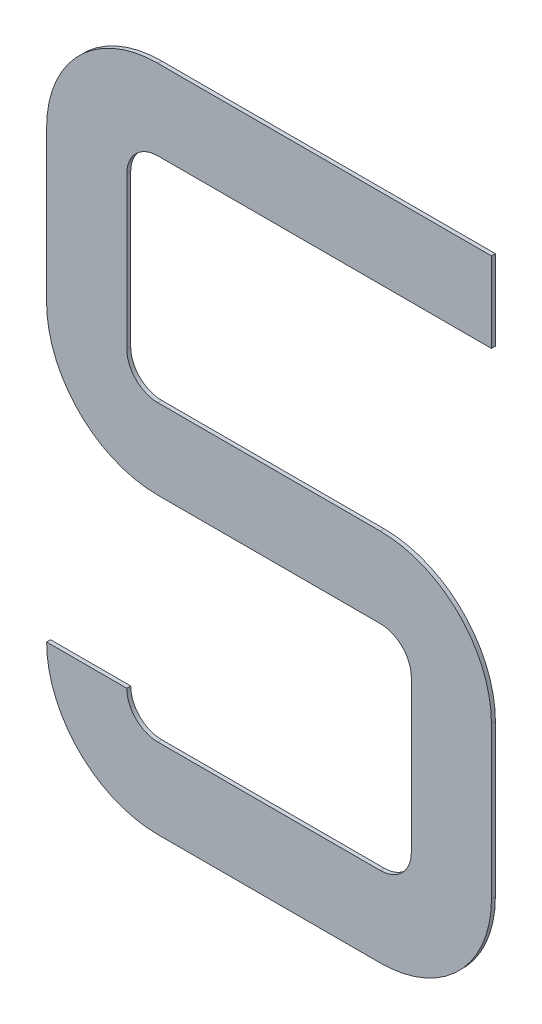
ISO-10303-21;
HEADER;
FILE_DESCRIPTION(('STEP AP214'),'2;1');
FILE_NAME('part.step','',(''),(''),'','','');
FILE_SCHEMA(('AUTOMOTIVE_DESIGN { 1 0 10303 214 1 1 1 1 }'));
ENDSEC;
DATA;
#1=APPLICATION_CONTEXT('core data for automotive mechanical design processes');
#2=APPLICATION_PROTOCOL_DEFINITION('international standard','automotive_design',2000,#1);
#3=PRODUCT_CONTEXT('',#1,'mechanical');
#4=PRODUCT('Part','Part','',(#3));
#5=PRODUCT_RELATED_PRODUCT_CATEGORY('part','',(#4));
#6=PRODUCT_DEFINITION_FORMATION('','',#4);
#7=PRODUCT_DEFINITION_CONTEXT('part definition',#1,'design');
#8=PRODUCT_DEFINITION('design','',#6,#7);
#9=PRODUCT_DEFINITION_SHAPE('','',#8);
#10=(LENGTH_UNIT() NAMED_UNIT(*) SI_UNIT(.MILLI.,.METRE.));
#11=(NAMED_UNIT(*) PLANE_ANGLE_UNIT() SI_UNIT($,.RADIAN.));
#12=(NAMED_UNIT(*) SI_UNIT($,.STERADIAN.) SOLID_ANGLE_UNIT());
#13=UNCERTAINTY_MEASURE_WITH_UNIT(LENGTH_MEASURE(1.E-05),#10,'distance_accuracy_value','');
#14=(GEOMETRIC_REPRESENTATION_CONTEXT(3) GLOBAL_UNCERTAINTY_ASSIGNED_CONTEXT((#13)) GLOBAL_UNIT_ASSIGNED_CONTEXT((#10,
#11,#12)) REPRESENTATION_CONTEXT('',''));
#15=CARTESIAN_POINT('',(0.,0.,0.));
#16=DIRECTION('',(0.,0.,1.));
#17=DIRECTION('',(1.,0.,0.));
#18=AXIS2_PLACEMENT_3D('',#15,#16,#17);
#19=CARTESIAN_POINT('',(-2.8305,14.1695,0.));
#20=DIRECTION('',(0.,0.,1.));
#21=DIRECTION('',(-1.,0.,0.));
#22=AXIS2_PLACEMENT_3D('',#19,#20,#21);
#23=CYLINDRICAL_SURFACE('',#22,0.7905);
#24=CARTESIAN_POINT('',(-2.8305,14.1695,0.1));
#25=DIRECTION('',(0.,0.,-1.));
#26=DIRECTION('',(1.,0.,0.));
#27=AXIS2_PLACEMENT_3D('',#24,#25,#26);
#28=CIRCLE('',#27,0.7905);
#29=CARTESIAN_POINT('',(-3.621,14.1695,0.1));
#30=VERTEX_POINT('',#29);
#31=CARTESIAN_POINT('',(-2.8305,14.96,0.1));
#32=VERTEX_POINT('',#31);
#33=EDGE_CURVE('E239',#30,#32,#28,.T.);
#34=ORIENTED_EDGE('',*,*,#33,.F.);
#35=DIRECTION('',(0.,0.,1.));
#36=VECTOR('',#35,1.);
#37=CARTESIAN_POINT('',(-3.621,14.1695,0.));
#38=LINE('',#37,#36);
#39=CARTESIAN_POINT('',(-3.621,14.1695,0.));
#40=VERTEX_POINT('',#39);
#41=EDGE_CURVE('E9',#40,#30,#38,.T.);
#42=ORIENTED_EDGE('',*,*,#41,.F.);
#43=CARTESIAN_POINT('',(-2.8305,14.1695,0.));
#44=DIRECTION('',(0.,0.,-1.));
#45=DIRECTION('',(1.,0.,0.));
#46=AXIS2_PLACEMENT_3D('',#43,#44,#45);
#47=CIRCLE('',#46,0.7905);
#48=CARTESIAN_POINT('',(-2.8305,14.96,0.));
#49=VERTEX_POINT('',#48);
#50=EDGE_CURVE('E314',#40,#49,#47,.T.);
#51=ORIENTED_EDGE('',*,*,#50,.T.);
#52=DIRECTION('',(0.,0.,1.));
#53=VECTOR('',#52,1.);
#54=CARTESIAN_POINT('',(-2.8305,14.96,0.));
#55=LINE('',#54,#53);
#56=EDGE_CURVE('E236',#49,#32,#55,.T.);
#57=ORIENTED_EDGE('',*,*,#56,.T.);
#58=EDGE_LOOP('',(#34,#42,#51,#57));
#59=FACE_BOUND('',#58,.T.);
#60=ADVANCED_FACE('F14',(#59),#23,.F.);
#61=CARTESIAN_POINT('',(-3.621,14.1695,0.));
#62=DIRECTION('',(-1.,0.,0.));
#63=DIRECTION('',(0.,0.,-1.));
#64=AXIS2_PLACEMENT_3D('',#61,#62,#63);
#65=PLANE('',#64);
#66=DIRECTION('',(0.,-1.,0.));
#67=VECTOR('',#66,1.);
#68=CARTESIAN_POINT('',(-3.621,14.1695,0.1));
#69=LINE('',#68,#67);
#70=CARTESIAN_POINT('',(-3.621,10.3105,0.1));
#71=VERTEX_POINT('',#70);
#72=EDGE_CURVE('E311',#30,#71,#69,.T.);
#73=ORIENTED_EDGE('',*,*,#72,.T.);
#74=DIRECTION('',(0.,0.,1.));
#75=VECTOR('',#74,1.);
#76=CARTESIAN_POINT('',(-3.621,10.3105,0.));
#77=LINE('',#76,#75);
#78=CARTESIAN_POINT('',(-3.621,10.3105,0.));
#79=VERTEX_POINT('',#78);
#80=EDGE_CURVE('E23',#79,#71,#77,.T.);
#81=ORIENTED_EDGE('',*,*,#80,.F.);
#82=DIRECTION('',(0.,-1.,0.));
#83=VECTOR('',#82,1.);
#84=CARTESIAN_POINT('',(-3.621,14.1695,0.));
#85=LINE('',#84,#83);
#86=EDGE_CURVE('E45',#40,#79,#85,.T.);
#87=ORIENTED_EDGE('',*,*,#86,.F.);
#88=ORIENTED_EDGE('',*,*,#41,.T.);
#89=EDGE_LOOP('',(#73,#81,#87,#88));
#90=FACE_BOUND('',#89,.T.);
#91=ADVANCED_FACE('F529',(#90),#65,.F.);
#92=CARTESIAN_POINT('',(-2.8305,10.3105,0.));
#93=DIRECTION('',(0.,0.,1.));
#94=DIRECTION('',(-1.,0.,0.));
#95=AXIS2_PLACEMENT_3D('',#92,#93,#94);
#96=CYLINDRICAL_SURFACE('',#95,0.7905);
#97=CARTESIAN_POINT('',(-2.8305,10.3105,0.1));
#98=DIRECTION('',(0.,0.,-1.));
#99=DIRECTION('',(1.,0.,0.));
#100=AXIS2_PLACEMENT_3D('',#97,#98,#99);
#101=CIRCLE('',#100,0.7905);
#102=CARTESIAN_POINT('',(-2.8305,9.52,0.1));
#103=VERTEX_POINT('',#102);
#104=EDGE_CURVE('E307',#103,#71,#101,.T.);
#105=ORIENTED_EDGE('',*,*,#104,.F.);
#106=DIRECTION('',(0.,0.,1.));
#107=VECTOR('',#106,1.);
#108=CARTESIAN_POINT('',(-2.8305,9.52,0.));
#109=LINE('',#108,#107);
#110=CARTESIAN_POINT('',(-2.8305,9.52,0.));
#111=VERTEX_POINT('',#110);
#112=EDGE_CURVE('E387',#111,#103,#109,.T.);
#113=ORIENTED_EDGE('',*,*,#112,.F.);
#114=CARTESIAN_POINT('',(-2.8305,10.3105,0.));
#115=DIRECTION('',(0.,0.,-1.));
#116=DIRECTION('',(1.,0.,0.));
#117=AXIS2_PLACEMENT_3D('',#114,#115,#116);
#118=CIRCLE('',#117,0.7905);
#119=EDGE_CURVE('E378',#111,#79,#118,.T.);
#120=ORIENTED_EDGE('',*,*,#119,.T.);
#121=ORIENTED_EDGE('',*,*,#80,.T.);
#122=EDGE_LOOP('',(#105,#113,#120,#121));
#123=FACE_BOUND('',#122,.T.);
#124=ADVANCED_FACE('F527',(#123),#96,.F.);
#125=CARTESIAN_POINT('',(-2.8305,9.52,0.));
#126=DIRECTION('',(0.,-1.,0.));
#127=DIRECTION('',(0.,0.,-1.));
#128=AXIS2_PLACEMENT_3D('',#125,#126,#127);
#129=PLANE('',#128);
#130=DIRECTION('',(1.,0.,0.));
#131=VECTOR('',#130,1.);
#132=CARTESIAN_POINT('',(-2.8305,9.52,0.1));
#133=LINE('',#132,#131);
#134=CARTESIAN_POINT('',(2.8305,9.52,0.1));
#135=VERTEX_POINT('',#134);
#136=EDGE_CURVE('E304',#103,#135,#133,.T.);
#137=ORIENTED_EDGE('',*,*,#136,.T.);
#138=DIRECTION('',(0.,0.,1.));
#139=VECTOR('',#138,1.);
#140=CARTESIAN_POINT('',(2.8305,9.52,0.));
#141=LINE('',#140,#139);
#142=CARTESIAN_POINT('',(2.8305,9.52,0.));
#143=VERTEX_POINT('',#142);
#144=EDGE_CURVE('E390',#143,#135,#141,.T.);
#145=ORIENTED_EDGE('',*,*,#144,.F.);
#146=DIRECTION('',(1.,0.,0.));
#147=VECTOR('',#146,1.);
#148=CARTESIAN_POINT('',(-2.8305,9.52,0.));
#149=LINE('',#148,#147);
#150=EDGE_CURVE('E375',#111,#143,#149,.T.);
#151=ORIENTED_EDGE('',*,*,#150,.F.);
#152=ORIENTED_EDGE('',*,*,#112,.T.);
#153=EDGE_LOOP('',(#137,#145,#151,#152));
#154=FACE_BOUND('',#153,.T.);
#155=ADVANCED_FACE('F525',(#154),#129,.F.);
#156=CARTESIAN_POINT('',(2.8305,6.6895,0.));
#157=DIRECTION('',(0.,0.,1.));
#158=DIRECTION('',(-1.,0.,0.));
#159=AXIS2_PLACEMENT_3D('',#156,#157,#158);
#160=CYLINDRICAL_SURFACE('',#159,2.8305);
#161=CARTESIAN_POINT('',(2.8305,6.6895,0.1));
#162=DIRECTION('',(0.,0.,-1.));
#163=DIRECTION('',(1.,0.,0.));
#164=AXIS2_PLACEMENT_3D('',#161,#162,#163);
#165=CIRCLE('',#164,2.8305);
#166=CARTESIAN_POINT('',(5.661,6.6895,0.1));
#167=VERTEX_POINT('',#166);
#168=EDGE_CURVE('E301',#135,#167,#165,.T.);
#169=ORIENTED_EDGE('',*,*,#168,.T.);
#170=DIRECTION('',(0.,0.,1.));
#171=VECTOR('',#170,1.);
#172=CARTESIAN_POINT('',(5.661,6.6895,0.));
#173=LINE('',#172,#171);
#174=CARTESIAN_POINT('',(5.661,6.6895,0.));
#175=VERTEX_POINT('',#174);
#176=EDGE_CURVE('E394',#175,#167,#173,.T.);
#177=ORIENTED_EDGE('',*,*,#176,.F.);
#178=CARTESIAN_POINT('',(2.8305,6.6895,0.));
#179=DIRECTION('',(0.,0.,-1.));
#180=DIRECTION('',(1.,0.,0.));
#181=AXIS2_PLACEMENT_3D('',#178,#179,#180);
#182=CIRCLE('',#181,2.8305);
#183=EDGE_CURVE('E372',#143,#175,#182,.T.);
#184=ORIENTED_EDGE('',*,*,#183,.F.);
#185=ORIENTED_EDGE('',*,*,#144,.T.);
#186=EDGE_LOOP('',(#169,#177,#184,#185));
#187=FACE_BOUND('',#186,.T.);
#188=ADVANCED_FACE('F520',(#187),#160,.T.);
#189=CARTESIAN_POINT('',(5.661,6.6895,0.));
#190=DIRECTION('',(-1.,0.,0.));
#191=DIRECTION('',(0.,0.,-1.));
#192=AXIS2_PLACEMENT_3D('',#189,#190,#191);
#193=PLANE('',#192);
#194=DIRECTION('',(0.,-1.,0.));
#195=VECTOR('',#194,1.);
#196=CARTESIAN_POINT('',(5.661,6.6895,0.1));
#197=LINE('',#196,#195);
#198=CARTESIAN_POINT('',(5.661,2.8305,0.1));
#199=VERTEX_POINT('',#198);
#200=EDGE_CURVE('E298',#167,#199,#197,.T.);
#201=ORIENTED_EDGE('',*,*,#200,.T.);
#202=DIRECTION('',(0.,0.,1.));
#203=VECTOR('',#202,1.);
#204=CARTESIAN_POINT('',(5.661,2.8305,0.));
#205=LINE('',#204,#203);
#206=CARTESIAN_POINT('',(5.661,2.8305,0.));
#207=VERTEX_POINT('',#206);
#208=EDGE_CURVE('E398',#207,#199,#205,.T.);
#209=ORIENTED_EDGE('',*,*,#208,.F.);
#210=DIRECTION('',(0.,-1.,0.));
#211=VECTOR('',#210,1.);
#212=CARTESIAN_POINT('',(5.661,6.6895,0.));
#213=LINE('',#212,#211);
#214=EDGE_CURVE('E369',#175,#207,#213,.T.);
#215=ORIENTED_EDGE('',*,*,#214,.F.);
#216=ORIENTED_EDGE('',*,*,#176,.T.);
#217=EDGE_LOOP('',(#201,#209,#215,#216));
#218=FACE_BOUND('',#217,.T.);
#219=ADVANCED_FACE('F514',(#218),#193,.F.);
#220=CARTESIAN_POINT('',(2.8305,2.8305,0.));
#221=DIRECTION('',(0.,0.,1.));
#222=DIRECTION('',(-1.,0.,0.));
#223=AXIS2_PLACEMENT_3D('',#220,#221,#222);
#224=CYLINDRICAL_SURFACE('',#223,2.8305);
#225=CARTESIAN_POINT('',(2.8305,2.8305,0.1));
#226=DIRECTION('',(0.,0.,-1.));
#227=DIRECTION('',(1.,0.,0.));
#228=AXIS2_PLACEMENT_3D('',#225,#226,#227);
#229=CIRCLE('',#228,2.8305);
#230=CARTESIAN_POINT('',(2.8305,0.,0.1));
#231=VERTEX_POINT('',#230);
#232=EDGE_CURVE('E295',#199,#231,#229,.T.);
#233=ORIENTED_EDGE('',*,*,#232,.T.);
#234=DIRECTION('',(0.,0.,1.));
#235=VECTOR('',#234,1.);
#236=CARTESIAN_POINT('',(2.8305,0.,0.));
#237=LINE('',#236,#235);
#238=CARTESIAN_POINT('',(2.8305,0.,0.));
#239=VERTEX_POINT('',#238);
#240=EDGE_CURVE('E402',#239,#231,#237,.T.);
#241=ORIENTED_EDGE('',*,*,#240,.F.);
#242=CARTESIAN_POINT('',(2.8305,2.8305,0.));
#243=DIRECTION('',(0.,0.,-1.));
#244=DIRECTION('',(1.,0.,0.));
#245=AXIS2_PLACEMENT_3D('',#242,#243,#244);
#246=CIRCLE('',#245,2.8305);
#247=EDGE_CURVE('E366',#207,#239,#246,.T.);
#248=ORIENTED_EDGE('',*,*,#247,.F.);
#249=ORIENTED_EDGE('',*,*,#208,.T.);
#250=EDGE_LOOP('',(#233,#241,#248,#249));
#251=FACE_BOUND('',#250,.T.);
#252=ADVANCED_FACE('F510',(#251),#224,.T.);
#253=CARTESIAN_POINT('',(2.8305,0.,0.));
#254=DIRECTION('',(0.,1.,0.));
#255=DIRECTION('',(0.,0.,1.));
#256=AXIS2_PLACEMENT_3D('',#253,#254,#255);
#257=PLANE('',#256);
#258=DIRECTION('',(-1.,0.,0.));
#259=VECTOR('',#258,1.);
#260=CARTESIAN_POINT('',(2.8305,0.,0.1));
#261=LINE('',#260,#259);
#262=CARTESIAN_POINT('',(-2.8305,0.,0.1));
#263=VERTEX_POINT('',#262);
#264=EDGE_CURVE('E292',#231,#263,#261,.T.);
#265=ORIENTED_EDGE('',*,*,#264,.T.);
#266=DIRECTION('',(0.,0.,1.));
#267=VECTOR('',#266,1.);
#268=CARTESIAN_POINT('',(-2.8305,0.,0.));
#269=LINE('',#268,#267);
#270=CARTESIAN_POINT('',(-2.8305,0.,0.));
#271=VERTEX_POINT('',#270);
#272=EDGE_CURVE('E406',#271,#263,#269,.T.);
#273=ORIENTED_EDGE('',*,*,#272,.F.);
#274=DIRECTION('',(-1.,0.,0.));
#275=VECTOR('',#274,1.);
#276=CARTESIAN_POINT('',(2.8305,0.,0.));
#277=LINE('',#276,#275);
#278=EDGE_CURVE('E363',#239,#271,#277,.T.);
#279=ORIENTED_EDGE('',*,*,#278,.F.);
#280=ORIENTED_EDGE('',*,*,#240,.T.);
#281=EDGE_LOOP('',(#265,#273,#279,#280));
#282=FACE_BOUND('',#281,.T.);
#283=ADVANCED_FACE('F505',(#282),#257,.F.);
#284=CARTESIAN_POINT('',(-2.8305,2.8305,0.));
#285=DIRECTION('',(0.,0.,1.));
#286=DIRECTION('',(-1.,0.,0.));
#287=AXIS2_PLACEMENT_3D('',#284,#285,#286);
#288=CYLINDRICAL_SURFACE('',#287,2.8305);
#289=CARTESIAN_POINT('',(-2.8305,2.8305,0.1));
#290=DIRECTION('',(0.,0.,-1.));
#291=DIRECTION('',(1.,0.,0.));
#292=AXIS2_PLACEMENT_3D('',#289,#290,#291);
#293=CIRCLE('',#292,2.8305);
#294=CARTESIAN_POINT('',(-5.661,2.8305,0.1));
#295=VERTEX_POINT('',#294);
#296=EDGE_CURVE('E289',#263,#295,#293,.T.);
#297=ORIENTED_EDGE('',*,*,#296,.T.);
#298=DIRECTION('',(0.,0.,1.));
#299=VECTOR('',#298,1.);
#300=CARTESIAN_POINT('',(-5.661,2.8305,0.));
#301=LINE('',#300,#299);
#302=CARTESIAN_POINT('',(-5.661,2.8305,0.));
#303=VERTEX_POINT('',#302);
#304=EDGE_CURVE('E410',#303,#295,#301,.T.);
#305=ORIENTED_EDGE('',*,*,#304,.F.);
#306=CARTESIAN_POINT('',(-2.8305,2.8305,0.));
#307=DIRECTION('',(0.,0.,-1.));
#308=DIRECTION('',(1.,0.,0.));
#309=AXIS2_PLACEMENT_3D('',#306,#307,#308);
#310=CIRCLE('',#309,2.8305);
#311=EDGE_CURVE('E360',#271,#303,#310,.T.);
#312=ORIENTED_EDGE('',*,*,#311,.F.);
#313=ORIENTED_EDGE('',*,*,#272,.T.);
#314=EDGE_LOOP('',(#297,#305,#312,#313));
#315=FACE_BOUND('',#314,.T.);
#316=ADVANCED_FACE('F499',(#315),#288,.T.);
#317=CARTESIAN_POINT('',(-5.661,2.8305,0.));
#318=DIRECTION('',(0.,-1.,0.));
#319=DIRECTION('',(0.,0.,-1.));
#320=AXIS2_PLACEMENT_3D('',#317,#318,#319);
#321=PLANE('',#320);
#322=DIRECTION('',(1.,0.,0.));
#323=VECTOR('',#322,1.);
#324=CARTESIAN_POINT('',(-5.661,2.8305,0.1));
#325=LINE('',#324,#323);
#326=CARTESIAN_POINT('',(-3.621,2.8305,0.1));
#327=VERTEX_POINT('',#326);
#328=EDGE_CURVE('E285',#295,#327,#325,.T.);
#329=ORIENTED_EDGE('',*,*,#328,.T.);
#330=DIRECTION('',(0.,0.,1.));
#331=VECTOR('',#330,1.);
#332=CARTESIAN_POINT('',(-3.621,2.8305,0.));
#333=LINE('',#332,#331);
#334=CARTESIAN_POINT('',(-3.621,2.8305,0.));
#335=VERTEX_POINT('',#334);
#336=EDGE_CURVE('E414',#335,#327,#333,.T.);
#337=ORIENTED_EDGE('',*,*,#336,.F.);
#338=DIRECTION('',(1.,0.,0.));
#339=VECTOR('',#338,1.);
#340=CARTESIAN_POINT('',(-5.661,2.8305,0.));
#341=LINE('',#340,#339);
#342=EDGE_CURVE('E357',#303,#335,#341,.T.);
#343=ORIENTED_EDGE('',*,*,#342,.F.);
#344=ORIENTED_EDGE('',*,*,#304,.T.);
#345=EDGE_LOOP('',(#329,#337,#343,#344));
#346=FACE_BOUND('',#345,.T.);
#347=ADVANCED_FACE('F495',(#346),#321,.F.);
#348=CARTESIAN_POINT('',(-2.8305,2.8305,0.));
#349=DIRECTION('',(0.,0.,1.));
#350=DIRECTION('',(-1.,0.,0.));
#351=AXIS2_PLACEMENT_3D('',#348,#349,#350);
#352=CYLINDRICAL_SURFACE('',#351,0.7905);
#353=CARTESIAN_POINT('',(-2.8305,2.8305,0.1));
#354=DIRECTION('',(0.,0.,-1.));
#355=DIRECTION('',(1.,0.,0.));
#356=AXIS2_PLACEMENT_3D('',#353,#354,#355);
#357=CIRCLE('',#356,0.7905);
#358=CARTESIAN_POINT('',(-2.8305,2.04,0.1));
#359=VERTEX_POINT('',#358);
#360=EDGE_CURVE('E281',#359,#327,#357,.T.);
#361=ORIENTED_EDGE('',*,*,#360,.F.);
#362=DIRECTION('',(0.,0.,1.));
#363=VECTOR('',#362,1.);
#364=CARTESIAN_POINT('',(-2.8305,2.04,0.));
#365=LINE('',#364,#363);
#366=CARTESIAN_POINT('',(-2.8305,2.04,0.));
#367=VERTEX_POINT('',#366);
#368=EDGE_CURVE('E417',#367,#359,#365,.T.);
#369=ORIENTED_EDGE('',*,*,#368,.F.);
#370=CARTESIAN_POINT('',(-2.8305,2.8305,0.));
#371=DIRECTION('',(0.,0.,-1.));
#372=DIRECTION('',(1.,0.,0.));
#373=AXIS2_PLACEMENT_3D('',#370,#371,#372);
#374=CIRCLE('',#373,0.7905);
#375=EDGE_CURVE('E353',#367,#335,#374,.T.);
#376=ORIENTED_EDGE('',*,*,#375,.T.);
#377=ORIENTED_EDGE('',*,*,#336,.T.);
#378=EDGE_LOOP('',(#361,#369,#376,#377));
#379=FACE_BOUND('',#378,.T.);
#380=ADVANCED_FACE('F490',(#379),#352,.F.);
#381=CARTESIAN_POINT('',(2.8305,2.04,0.));
#382=DIRECTION('',(0.,1.,0.));
#383=DIRECTION('',(0.,0.,1.));
#384=AXIS2_PLACEMENT_3D('',#381,#382,#383);
#385=PLANE('',#384);
#386=DIRECTION('',(-1.,0.,0.));
#387=VECTOR('',#386,1.);
#388=CARTESIAN_POINT('',(2.8305,2.04,0.1));
#389=LINE('',#388,#387);
#390=CARTESIAN_POINT('',(2.8305,2.04,0.1));
#391=VERTEX_POINT('',#390);
#392=EDGE_CURVE('E277',#391,#359,#389,.T.);
#393=ORIENTED_EDGE('',*,*,#392,.F.);
#394=DIRECTION('',(0.,0.,1.));
#395=VECTOR('',#394,1.);
#396=CARTESIAN_POINT('',(2.8305,2.04,0.));
#397=LINE('',#396,#395);
#398=CARTESIAN_POINT('',(2.8305,2.04,0.));
#399=VERTEX_POINT('',#398);
#400=EDGE_CURVE('E420',#399,#391,#397,.T.);
#401=ORIENTED_EDGE('',*,*,#400,.F.);
#402=DIRECTION('',(-1.,0.,0.));
#403=VECTOR('',#402,1.);
#404=CARTESIAN_POINT('',(2.8305,2.04,0.));
#405=LINE('',#404,#403);
#406=EDGE_CURVE('E349',#399,#367,#405,.T.);
#407=ORIENTED_EDGE('',*,*,#406,.T.);
#408=ORIENTED_EDGE('',*,*,#368,.T.);
#409=EDGE_LOOP('',(#393,#401,#407,#408));
#410=FACE_BOUND('',#409,.T.);
#411=ADVANCED_FACE('F485',(#410),#385,.T.);
#412=CARTESIAN_POINT('',(2.8305,2.8305,0.));
#413=DIRECTION('',(0.,0.,1.));
#414=DIRECTION('',(-1.,0.,0.));
#415=AXIS2_PLACEMENT_3D('',#412,#413,#414);
#416=CYLINDRICAL_SURFACE('',#415,0.7905);
#417=CARTESIAN_POINT('',(2.8305,2.8305,0.1));
#418=DIRECTION('',(0.,0.,-1.));
#419=DIRECTION('',(1.,0.,0.));
#420=AXIS2_PLACEMENT_3D('',#417,#418,#419);
#421=CIRCLE('',#420,0.7905);
#422=CARTESIAN_POINT('',(3.621,2.8305,0.1));
#423=VERTEX_POINT('',#422);
#424=EDGE_CURVE('E273',#423,#391,#421,.T.);
#425=ORIENTED_EDGE('',*,*,#424,.F.);
#426=DIRECTION('',(0.,0.,1.));
#427=VECTOR('',#426,1.);
#428=CARTESIAN_POINT('',(3.621,2.8305,0.));
#429=LINE('',#428,#427);
#430=CARTESIAN_POINT('',(3.621,2.8305,0.));
#431=VERTEX_POINT('',#430);
#432=EDGE_CURVE('E423',#431,#423,#429,.T.);
#433=ORIENTED_EDGE('',*,*,#432,.F.);
#434=CARTESIAN_POINT('',(2.8305,2.8305,0.));
#435=DIRECTION('',(0.,0.,-1.));
#436=DIRECTION('',(1.,0.,0.));
#437=AXIS2_PLACEMENT_3D('',#434,#435,#436);
#438=CIRCLE('',#437,0.7905);
#439=EDGE_CURVE('E345',#431,#399,#438,.T.);
#440=ORIENTED_EDGE('',*,*,#439,.T.);
#441=ORIENTED_EDGE('',*,*,#400,.T.);
#442=EDGE_LOOP('',(#425,#433,#440,#441));
#443=FACE_BOUND('',#442,.T.);
#444=ADVANCED_FACE('F481',(#443),#416,.F.);
#445=CARTESIAN_POINT('',(3.621,6.6895,0.));
#446=DIRECTION('',(-1.,0.,0.));
#447=DIRECTION('',(0.,0.,-1.));
#448=AXIS2_PLACEMENT_3D('',#445,#446,#447);
#449=PLANE('',#448);
#450=DIRECTION('',(0.,-1.,0.));
#451=VECTOR('',#450,1.);
#452=CARTESIAN_POINT('',(3.621,6.6895,0.1));
#453=LINE('',#452,#451);
#454=CARTESIAN_POINT('',(3.621,6.6895,0.1));
#455=VERTEX_POINT('',#454);
#456=EDGE_CURVE('E269',#455,#423,#453,.T.);
#457=ORIENTED_EDGE('',*,*,#456,.F.);
#458=DIRECTION('',(0.,0.,1.));
#459=VECTOR('',#458,1.);
#460=CARTESIAN_POINT('',(3.621,6.6895,0.));
#461=LINE('',#460,#459);
#462=CARTESIAN_POINT('',(3.621,6.6895,0.));
#463=VERTEX_POINT('',#462);
#464=EDGE_CURVE('E426',#463,#455,#461,.T.);
#465=ORIENTED_EDGE('',*,*,#464,.F.);
#466=DIRECTION('',(0.,-1.,0.));
#467=VECTOR('',#466,1.);
#468=CARTESIAN_POINT('',(3.621,6.6895,0.));
#469=LINE('',#468,#467);
#470=EDGE_CURVE('E341',#463,#431,#469,.T.);
#471=ORIENTED_EDGE('',*,*,#470,.T.);
#472=ORIENTED_EDGE('',*,*,#432,.T.);
#473=EDGE_LOOP('',(#457,#465,#471,#472));
#474=FACE_BOUND('',#473,.T.);
#475=ADVANCED_FACE('F477',(#474),#449,.T.);
#476=CARTESIAN_POINT('',(2.8305,6.6895,0.));
#477=DIRECTION('',(0.,0.,1.));
#478=DIRECTION('',(-1.,0.,0.));
#479=AXIS2_PLACEMENT_3D('',#476,#477,#478);
#480=CYLINDRICAL_SURFACE('',#479,0.7905);
#481=CARTESIAN_POINT('',(2.8305,6.6895,0.1));
#482=DIRECTION('',(0.,0.,-1.));
#483=DIRECTION('',(1.,0.,0.));
#484=AXIS2_PLACEMENT_3D('',#481,#482,#483);
#485=CIRCLE('',#484,0.7905);
#486=CARTESIAN_POINT('',(2.8305,7.48,0.1));
#487=VERTEX_POINT('',#486);
#488=EDGE_CURVE('E265',#487,#455,#485,.T.);
#489=ORIENTED_EDGE('',*,*,#488,.F.);
#490=DIRECTION('',(0.,0.,1.));
#491=VECTOR('',#490,1.);
#492=CARTESIAN_POINT('',(2.8305,7.48,0.));
#493=LINE('',#492,#491);
#494=CARTESIAN_POINT('',(2.8305,7.48,0.));
#495=VERTEX_POINT('',#494);
#496=EDGE_CURVE('E429',#495,#487,#493,.T.);
#497=ORIENTED_EDGE('',*,*,#496,.F.);
#498=CARTESIAN_POINT('',(2.8305,6.6895,0.));
#499=DIRECTION('',(0.,0.,-1.));
#500=DIRECTION('',(1.,0.,0.));
#501=AXIS2_PLACEMENT_3D('',#498,#499,#500);
#502=CIRCLE('',#501,0.7905);
#503=EDGE_CURVE('E337',#495,#463,#502,.T.);
#504=ORIENTED_EDGE('',*,*,#503,.T.);
#505=ORIENTED_EDGE('',*,*,#464,.T.);
#506=EDGE_LOOP('',(#489,#497,#504,#505));
#507=FACE_BOUND('',#506,.T.);
#508=ADVANCED_FACE('F473',(#507),#480,.F.);
#509=CARTESIAN_POINT('',(-2.8305,7.48,0.));
#510=DIRECTION('',(0.,-1.,0.));
#511=DIRECTION('',(0.,0.,-1.));
#512=AXIS2_PLACEMENT_3D('',#509,#510,#511);
#513=PLANE('',#512);
#514=DIRECTION('',(1.,0.,0.));
#515=VECTOR('',#514,1.);
#516=CARTESIAN_POINT('',(-2.8305,7.48,0.1));
#517=LINE('',#516,#515);
#518=CARTESIAN_POINT('',(-2.8305,7.48,0.1));
#519=VERTEX_POINT('',#518);
#520=EDGE_CURVE('E261',#519,#487,#517,.T.);
#521=ORIENTED_EDGE('',*,*,#520,.F.);
#522=DIRECTION('',(0.,0.,1.));
#523=VECTOR('',#522,1.);
#524=CARTESIAN_POINT('',(-2.8305,7.48,0.));
#525=LINE('',#524,#523);
#526=CARTESIAN_POINT('',(-2.8305,7.48,0.));
#527=VERTEX_POINT('',#526);
#528=EDGE_CURVE('E432',#527,#519,#525,.T.);
#529=ORIENTED_EDGE('',*,*,#528,.F.);
#530=DIRECTION('',(1.,0.,0.));
#531=VECTOR('',#530,1.);
#532=CARTESIAN_POINT('',(-2.8305,7.48,0.));
#533=LINE('',#532,#531);
#534=EDGE_CURVE('E333',#527,#495,#533,.T.);
#535=ORIENTED_EDGE('',*,*,#534,.T.);
#536=ORIENTED_EDGE('',*,*,#496,.T.);
#537=EDGE_LOOP('',(#521,#529,#535,#536));
#538=FACE_BOUND('',#537,.T.);
#539=ADVANCED_FACE('F468',(#538),#513,.T.);
#540=CARTESIAN_POINT('',(-2.8305,10.3105,0.));
#541=DIRECTION('',(0.,0.,1.));
#542=DIRECTION('',(-1.,0.,0.));
#543=AXIS2_PLACEMENT_3D('',#540,#541,#542);
#544=CYLINDRICAL_SURFACE('',#543,2.8305);
#545=CARTESIAN_POINT('',(-2.8305,10.3105,0.1));
#546=DIRECTION('',(0.,0.,-1.));
#547=DIRECTION('',(1.,0.,0.));
#548=AXIS2_PLACEMENT_3D('',#545,#546,#547);
#549=CIRCLE('',#548,2.8305);
#550=CARTESIAN_POINT('',(-5.661,10.3105,0.1));
#551=VERTEX_POINT('',#550);
#552=EDGE_CURVE('E257',#519,#551,#549,.T.);
#553=ORIENTED_EDGE('',*,*,#552,.T.);
#554=DIRECTION('',(0.,0.,1.));
#555=VECTOR('',#554,1.);
#556=CARTESIAN_POINT('',(-5.661,10.3105,0.));
#557=LINE('',#556,#555);
#558=CARTESIAN_POINT('',(-5.661,10.3105,0.));
#559=VERTEX_POINT('',#558);
#560=EDGE_CURVE('E435',#559,#551,#557,.T.);
#561=ORIENTED_EDGE('',*,*,#560,.F.);
#562=CARTESIAN_POINT('',(-2.8305,10.3105,0.));
#563=DIRECTION('',(0.,0.,-1.));
#564=DIRECTION('',(1.,0.,0.));
#565=AXIS2_PLACEMENT_3D('',#562,#563,#564);
#566=CIRCLE('',#565,2.8305);
#567=EDGE_CURVE('E330',#527,#559,#566,.T.);
#568=ORIENTED_EDGE('',*,*,#567,.F.);
#569=ORIENTED_EDGE('',*,*,#528,.T.);
#570=EDGE_LOOP('',(#553,#561,#568,#569));
#571=FACE_BOUND('',#570,.T.);
#572=ADVANCED_FACE('F465',(#571),#544,.T.);
#573=CARTESIAN_POINT('',(-5.661,14.1695,0.));
#574=DIRECTION('',(-1.,0.,0.));
#575=DIRECTION('',(0.,0.,-1.));
#576=AXIS2_PLACEMENT_3D('',#573,#574,#575);
#577=PLANE('',#576);
#578=DIRECTION('',(0.,-1.,0.));
#579=VECTOR('',#578,1.);
#580=CARTESIAN_POINT('',(-5.661,14.1695,0.1));
#581=LINE('',#580,#579);
#582=CARTESIAN_POINT('',(-5.661,14.1695,0.1));
#583=VERTEX_POINT('',#582);
#584=EDGE_CURVE('E253',#583,#551,#581,.T.);
#585=ORIENTED_EDGE('',*,*,#584,.F.);
#586=DIRECTION('',(0.,0.,1.));
#587=VECTOR('',#586,1.);
#588=CARTESIAN_POINT('',(-5.661,14.1695,0.));
#589=LINE('',#588,#587);
#590=CARTESIAN_POINT('',(-5.661,14.1695,0.));
#591=VERTEX_POINT('',#590);
#592=EDGE_CURVE('E438',#591,#583,#589,.T.);
#593=ORIENTED_EDGE('',*,*,#592,.F.);
#594=DIRECTION('',(0.,-1.,0.));
#595=VECTOR('',#594,1.);
#596=CARTESIAN_POINT('',(-5.661,14.1695,0.));
#597=LINE('',#596,#595);
#598=EDGE_CURVE('E326',#591,#559,#597,.T.);
#599=ORIENTED_EDGE('',*,*,#598,.T.);
#600=ORIENTED_EDGE('',*,*,#560,.T.);
#601=EDGE_LOOP('',(#585,#593,#599,#600));
#602=FACE_BOUND('',#601,.T.);
#603=ADVANCED_FACE('F461',(#602),#577,.T.);
#604=CARTESIAN_POINT('',(-2.8305,14.1695,0.));
#605=DIRECTION('',(0.,0.,1.));
#606=DIRECTION('',(-1.,0.,0.));
#607=AXIS2_PLACEMENT_3D('',#604,#605,#606);
#608=CYLINDRICAL_SURFACE('',#607,2.8305);
#609=CARTESIAN_POINT('',(-2.8305,14.1695,0.1));
#610=DIRECTION('',(0.,0.,-1.));
#611=DIRECTION('',(1.,0.,0.));
#612=AXIS2_PLACEMENT_3D('',#609,#610,#611);
#613=CIRCLE('',#612,2.8305);
#614=CARTESIAN_POINT('',(-2.8305,17.,0.1));
#615=VERTEX_POINT('',#614);
#616=EDGE_CURVE('E250',#583,#615,#613,.T.);
#617=ORIENTED_EDGE('',*,*,#616,.T.);
#618=DIRECTION('',(0.,0.,1.));
#619=VECTOR('',#618,1.);
#620=CARTESIAN_POINT('',(-2.8305,17.,0.));
#621=LINE('',#620,#619);
#622=CARTESIAN_POINT('',(-2.8305,17.,0.));
#623=VERTEX_POINT('',#622);
#624=EDGE_CURVE('E441',#623,#615,#621,.T.);
#625=ORIENTED_EDGE('',*,*,#624,.F.);
#626=CARTESIAN_POINT('',(-2.8305,14.1695,0.));
#627=DIRECTION('',(0.,0.,-1.));
#628=DIRECTION('',(1.,0.,0.));
#629=AXIS2_PLACEMENT_3D('',#626,#627,#628);
#630=CIRCLE('',#629,2.8305);
#631=EDGE_CURVE('E323',#591,#623,#630,.T.);
#632=ORIENTED_EDGE('',*,*,#631,.F.);
#633=ORIENTED_EDGE('',*,*,#592,.T.);
#634=EDGE_LOOP('',(#617,#625,#632,#633));
#635=FACE_BOUND('',#634,.T.);
#636=ADVANCED_FACE('F571',(#635),#608,.T.);
#637=CARTESIAN_POINT('',(-2.8305,17.,0.));
#638=DIRECTION('',(0.,-1.,0.));
#639=DIRECTION('',(0.,0.,-1.));
#640=AXIS2_PLACEMENT_3D('',#637,#638,#639);
#641=PLANE('',#640);
#642=DIRECTION('',(1.,0.,0.));
#643=VECTOR('',#642,1.);
#644=CARTESIAN_POINT('',(-2.8305,17.,0.1));
#645=LINE('',#644,#643);
#646=CARTESIAN_POINT('',(5.661,17.,0.1));
#647=VERTEX_POINT('',#646);
#648=EDGE_CURVE('E226',#615,#647,#645,.T.);
#649=ORIENTED_EDGE('',*,*,#648,.T.);
#650=DIRECTION('',(0.,0.,1.));
#651=VECTOR('',#650,1.);
#652=CARTESIAN_POINT('',(5.661,17.,0.));
#653=LINE('',#652,#651);
#654=CARTESIAN_POINT('',(5.661,17.,0.));
#655=VERTEX_POINT('',#654);
#656=EDGE_CURVE('E222',#655,#647,#653,.T.);
#657=ORIENTED_EDGE('',*,*,#656,.F.);
#658=DIRECTION('',(1.,0.,0.));
#659=VECTOR('',#658,1.);
#660=CARTESIAN_POINT('',(-2.8305,17.,0.));
#661=LINE('',#660,#659);
#662=EDGE_CURVE('E320',#623,#655,#661,.T.);
#663=ORIENTED_EDGE('',*,*,#662,.F.);
#664=ORIENTED_EDGE('',*,*,#624,.T.);
#665=EDGE_LOOP('',(#649,#657,#663,#664));
#666=FACE_BOUND('',#665,.T.);
#667=ADVANCED_FACE('F455',(#666),#641,.F.);
#668=CARTESIAN_POINT('',(5.661,17.,0.));
#669=DIRECTION('',(-1.,0.,0.));
#670=DIRECTION('',(0.,0.,-1.));
#671=AXIS2_PLACEMENT_3D('',#668,#669,#670);
#672=PLANE('',#671);
#673=DIRECTION('',(0.,-1.,0.));
#674=VECTOR('',#673,1.);
#675=CARTESIAN_POINT('',(5.661,17.,0.1));
#676=LINE('',#675,#674);
#677=CARTESIAN_POINT('',(5.661,14.96,0.1));
#678=VERTEX_POINT('',#677);
#679=EDGE_CURVE('E216',#647,#678,#676,.T.);
#680=ORIENTED_EDGE('',*,*,#679,.T.);
#681=DIRECTION('',(0.,0.,1.));
#682=VECTOR('',#681,1.);
#683=CARTESIAN_POINT('',(5.661,14.96,0.));
#684=LINE('',#683,#682);
#685=CARTESIAN_POINT('',(5.661,14.96,0.));
#686=VERTEX_POINT('',#685);
#687=EDGE_CURVE('E17',#686,#678,#684,.T.);
#688=ORIENTED_EDGE('',*,*,#687,.F.);
#689=DIRECTION('',(0.,-1.,0.));
#690=VECTOR('',#689,1.);
#691=CARTESIAN_POINT('',(5.661,17.,0.));
#692=LINE('',#691,#690);
#693=EDGE_CURVE('E317',#655,#686,#692,.T.);
#694=ORIENTED_EDGE('',*,*,#693,.F.);
#695=ORIENTED_EDGE('',*,*,#656,.T.);
#696=EDGE_LOOP('',(#680,#688,#694,#695));
#697=FACE_BOUND('',#696,.T.);
#698=ADVANCED_FACE('F218',(#697),#672,.F.);
#699=CARTESIAN_POINT('',(5.661,14.96,0.));
#700=DIRECTION('',(0.,1.,0.));
#701=DIRECTION('',(0.,0.,1.));
#702=AXIS2_PLACEMENT_3D('',#699,#700,#701);
#703=PLANE('',#702);
#704=DIRECTION('',(-1.,0.,0.));
#705=VECTOR('',#704,1.);
#706=CARTESIAN_POINT('',(5.661,14.96,0.1));
#707=LINE('',#706,#705);
#708=EDGE_CURVE('E227',#678,#32,#707,.T.);
#709=ORIENTED_EDGE('',*,*,#708,.T.);
#710=ORIENTED_EDGE('',*,*,#56,.F.);
#711=DIRECTION('',(-1.,0.,0.));
#712=VECTOR('',#711,1.);
#713=CARTESIAN_POINT('',(5.661,14.96,0.));
#714=LINE('',#713,#712);
#715=EDGE_CURVE('E234',#686,#49,#714,.T.);
#716=ORIENTED_EDGE('',*,*,#715,.F.);
#717=ORIENTED_EDGE('',*,*,#687,.T.);
#718=EDGE_LOOP('',(#709,#710,#716,#717));
#719=FACE_BOUND('',#718,.T.);
#720=ADVANCED_FACE('F231',(#719),#703,.F.);
#721=CARTESIAN_POINT('',(-2.8305,14.1695,0.));
#722=DIRECTION('',(0.,0.,-1.));
#723=DIRECTION('',(1.,0.,0.));
#724=AXIS2_PLACEMENT_3D('',#721,#722,#723);
#725=PLANE('',#724);
#726=ORIENTED_EDGE('',*,*,#50,.F.);
#727=ORIENTED_EDGE('',*,*,#86,.T.);
#728=ORIENTED_EDGE('',*,*,#119,.F.);
#729=ORIENTED_EDGE('',*,*,#150,.T.);
#730=ORIENTED_EDGE('',*,*,#183,.T.);
#731=ORIENTED_EDGE('',*,*,#214,.T.);
#732=ORIENTED_EDGE('',*,*,#247,.T.);
#733=ORIENTED_EDGE('',*,*,#278,.T.);
#734=ORIENTED_EDGE('',*,*,#311,.T.);
#735=ORIENTED_EDGE('',*,*,#342,.T.);
#736=ORIENTED_EDGE('',*,*,#375,.F.);
#737=ORIENTED_EDGE('',*,*,#406,.F.);
#738=ORIENTED_EDGE('',*,*,#439,.F.);
#739=ORIENTED_EDGE('',*,*,#470,.F.);
#740=ORIENTED_EDGE('',*,*,#503,.F.);
#741=ORIENTED_EDGE('',*,*,#534,.F.);
#742=ORIENTED_EDGE('',*,*,#567,.T.);
#743=ORIENTED_EDGE('',*,*,#598,.F.);
#744=ORIENTED_EDGE('',*,*,#631,.T.);
#745=ORIENTED_EDGE('',*,*,#662,.T.);
#746=ORIENTED_EDGE('',*,*,#693,.T.);
#747=ORIENTED_EDGE('',*,*,#715,.T.);
#748=EDGE_LOOP('',(#726,#727,#728,#729,#730,#731,#732,#733,#734,#735,#736,#737,#738,#739,#740,
#741,#742,#743,#744,#745,#746,#747));
#749=FACE_BOUND('',#748,.T.);
#750=ADVANCED_FACE('F449',(#749),#725,.T.);
#751=CARTESIAN_POINT('',(-2.8305,14.1695,0.1));
#752=DIRECTION('',(0.,0.,-1.));
#753=DIRECTION('',(1.,0.,0.));
#754=AXIS2_PLACEMENT_3D('',#751,#752,#753);
#755=PLANE('',#754);
#756=ORIENTED_EDGE('',*,*,#33,.T.);
#757=ORIENTED_EDGE('',*,*,#708,.F.);
#758=ORIENTED_EDGE('',*,*,#679,.F.);
#759=ORIENTED_EDGE('',*,*,#648,.F.);
#760=ORIENTED_EDGE('',*,*,#616,.F.);
#761=ORIENTED_EDGE('',*,*,#584,.T.);
#762=ORIENTED_EDGE('',*,*,#552,.F.);
#763=ORIENTED_EDGE('',*,*,#520,.T.);
#764=ORIENTED_EDGE('',*,*,#488,.T.);
#765=ORIENTED_EDGE('',*,*,#456,.T.);
#766=ORIENTED_EDGE('',*,*,#424,.T.);
#767=ORIENTED_EDGE('',*,*,#392,.T.);
#768=ORIENTED_EDGE('',*,*,#360,.T.);
#769=ORIENTED_EDGE('',*,*,#328,.F.);
#770=ORIENTED_EDGE('',*,*,#296,.F.);
#771=ORIENTED_EDGE('',*,*,#264,.F.);
#772=ORIENTED_EDGE('',*,*,#232,.F.);
#773=ORIENTED_EDGE('',*,*,#200,.F.);
#774=ORIENTED_EDGE('',*,*,#168,.F.);
#775=ORIENTED_EDGE('',*,*,#136,.F.);
#776=ORIENTED_EDGE('',*,*,#104,.T.);
#777=ORIENTED_EDGE('',*,*,#72,.F.);
#778=EDGE_LOOP('',(#756,#757,#758,#759,#760,#761,#762,#763,#764,#765,#766,#767,#768,#769,#770,
#771,#772,#773,#774,#775,#776,#777));
#779=FACE_BOUND('',#778,.T.);
#780=ADVANCED_FACE('F237',(#779),#755,.F.);
#781=CLOSED_SHELL('',(#60,#91,#124,#155,#188,#219,#252,#283,#316,#347,#380,#411,#444,#475,#508,
#539,#572,#603,#636,#667,#698,#720,#750,#780));
#782=MANIFOLD_SOLID_BREP('B1',#781);
#783=ADVANCED_BREP_SHAPE_REPRESENTATION('',(#18,#782),#14);
#784=SHAPE_DEFINITION_REPRESENTATION(#9,#783);
ENDSEC;
END-ISO-10303-21;
